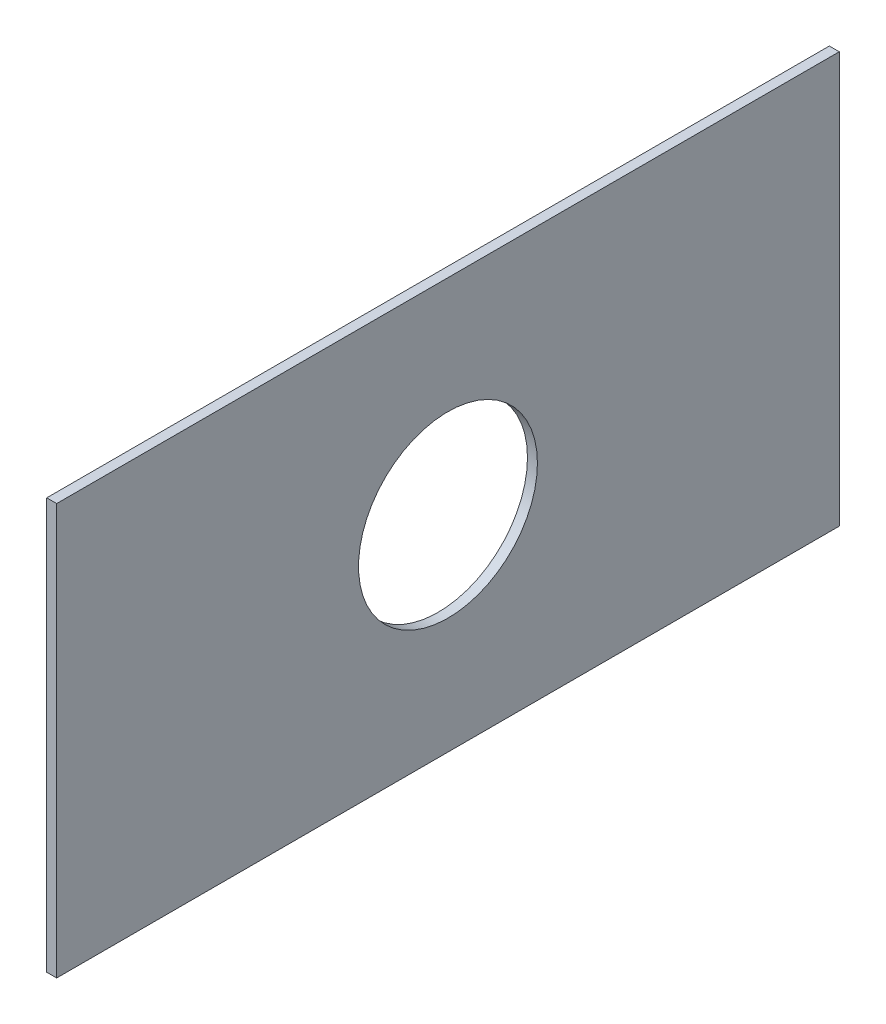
ISO-10303-21;
HEADER;
FILE_DESCRIPTION(('STEP AP214'),'2;1');
FILE_NAME('part.step','',(''),(''),'','','');
FILE_SCHEMA(('AUTOMOTIVE_DESIGN { 1 0 10303 214 1 1 1 1 }'));
ENDSEC;
DATA;
#1=APPLICATION_CONTEXT('core data for automotive mechanical design processes');
#2=APPLICATION_PROTOCOL_DEFINITION('international standard','automotive_design',2000,#1);
#3=PRODUCT_CONTEXT('',#1,'mechanical');
#4=PRODUCT('Part','Part','',(#3));
#5=PRODUCT_RELATED_PRODUCT_CATEGORY('part','',(#4));
#6=PRODUCT_DEFINITION_FORMATION('','',#4);
#7=PRODUCT_DEFINITION_CONTEXT('part definition',#1,'design');
#8=PRODUCT_DEFINITION('design','',#6,#7);
#9=PRODUCT_DEFINITION_SHAPE('','',#8);
#10=(LENGTH_UNIT() NAMED_UNIT(*) SI_UNIT(.MILLI.,.METRE.));
#11=(NAMED_UNIT(*) PLANE_ANGLE_UNIT() SI_UNIT($,.RADIAN.));
#12=(NAMED_UNIT(*) SI_UNIT($,.STERADIAN.) SOLID_ANGLE_UNIT());
#13=UNCERTAINTY_MEASURE_WITH_UNIT(LENGTH_MEASURE(1.E-05),#10,'distance_accuracy_value','');
#14=(GEOMETRIC_REPRESENTATION_CONTEXT(3) GLOBAL_UNCERTAINTY_ASSIGNED_CONTEXT((#13)) GLOBAL_UNIT_ASSIGNED_CONTEXT((#10,
#11,#12)) REPRESENTATION_CONTEXT('',''));
#15=CARTESIAN_POINT('',(0.,0.,0.));
#16=DIRECTION('',(0.,0.,1.));
#17=DIRECTION('',(1.,0.,0.));
#18=AXIS2_PLACEMENT_3D('',#15,#16,#17);
#19=CARTESIAN_POINT('',(12.7,0.,0.));
#20=DIRECTION('',(0.,0.,-1.));
#21=DIRECTION('',(-1.,0.,0.));
#22=AXIS2_PLACEMENT_3D('',#19,#20,#21);
#23=PLANE('',#22);
#24=DIRECTION('',(0.,-1.,0.));
#25=VECTOR('',#24,1.);
#26=CARTESIAN_POINT('',(0.,0.,0.));
#27=LINE('',#26,#25);
#28=CARTESIAN_POINT('',(0.,525.018,0.));
#29=VERTEX_POINT('',#28);
#30=CARTESIAN_POINT('',(0.,0.,0.));
#31=VERTEX_POINT('',#30);
#32=EDGE_CURVE('E94',#29,#31,#27,.T.);
#33=ORIENTED_EDGE('',*,*,#32,.T.);
#34=DIRECTION('',(-1.,0.,0.));
#35=VECTOR('',#34,1.);
#36=CARTESIAN_POINT('',(12.7,0.,0.));
#37=LINE('',#36,#35);
#38=CARTESIAN_POINT('',(12.7,0.,0.));
#39=VERTEX_POINT('',#38);
#40=EDGE_CURVE('E11',#39,#31,#37,.T.);
#41=ORIENTED_EDGE('',*,*,#40,.F.);
#42=DIRECTION('',(0.,-1.,0.));
#43=VECTOR('',#42,1.);
#44=CARTESIAN_POINT('',(12.7,0.,0.));
#45=LINE('',#44,#43);
#46=CARTESIAN_POINT('',(12.7,525.018,0.));
#47=VERTEX_POINT('',#46);
#48=EDGE_CURVE('E82',#47,#39,#45,.T.);
#49=ORIENTED_EDGE('',*,*,#48,.F.);
#50=DIRECTION('',(-1.,0.,0.));
#51=VECTOR('',#50,1.);
#52=CARTESIAN_POINT('',(12.7,525.018,0.));
#53=LINE('',#52,#51);
#54=EDGE_CURVE('E90',#47,#29,#53,.T.);
#55=ORIENTED_EDGE('',*,*,#54,.T.);
#56=EDGE_LOOP('',(#33,#41,#49,#55));
#57=FACE_BOUND('',#56,.T.);
#58=ADVANCED_FACE('F31',(#57),#23,.F.);
#59=CARTESIAN_POINT('',(12.7,0.,0.));
#60=DIRECTION('',(0.,1.,0.));
#61=DIRECTION('',(0.,0.,1.));
#62=AXIS2_PLACEMENT_3D('',#59,#60,#61);
#63=PLANE('',#62);
#64=DIRECTION('',(0.,0.,-1.));
#65=VECTOR('',#64,1.);
#66=CARTESIAN_POINT('',(0.,0.,0.));
#67=LINE('',#66,#65);
#68=CARTESIAN_POINT('',(0.,0.,-999.998));
#69=VERTEX_POINT('',#68);
#70=EDGE_CURVE('E86',#31,#69,#67,.T.);
#71=ORIENTED_EDGE('',*,*,#70,.T.);
#72=DIRECTION('',(-1.,0.,0.));
#73=VECTOR('',#72,1.);
#74=CARTESIAN_POINT('',(12.7,0.,-999.998));
#75=LINE('',#74,#73);
#76=CARTESIAN_POINT('',(12.7,0.,-999.998));
#77=VERTEX_POINT('',#76);
#78=EDGE_CURVE('E39',#77,#69,#75,.T.);
#79=ORIENTED_EDGE('',*,*,#78,.F.);
#80=DIRECTION('',(0.,0.,-1.));
#81=VECTOR('',#80,1.);
#82=CARTESIAN_POINT('',(12.7,0.,0.));
#83=LINE('',#82,#81);
#84=EDGE_CURVE('E77',#39,#77,#83,.T.);
#85=ORIENTED_EDGE('',*,*,#84,.F.);
#86=ORIENTED_EDGE('',*,*,#40,.T.);
#87=EDGE_LOOP('',(#71,#79,#85,#86));
#88=FACE_BOUND('',#87,.T.);
#89=ADVANCED_FACE('F85',(#88),#63,.F.);
#90=CARTESIAN_POINT('',(12.7,0.,-999.998));
#91=DIRECTION('',(0.,0.,1.));
#92=DIRECTION('',(1.,0.,0.));
#93=AXIS2_PLACEMENT_3D('',#90,#91,#92);
#94=PLANE('',#93);
#95=DIRECTION('',(0.,1.,0.));
#96=VECTOR('',#95,1.);
#97=CARTESIAN_POINT('',(0.,0.,-999.998));
#98=LINE('',#97,#96);
#99=CARTESIAN_POINT('',(0.,525.018,-999.998));
#100=VERTEX_POINT('',#99);
#101=EDGE_CURVE('E64',#69,#100,#98,.T.);
#102=ORIENTED_EDGE('',*,*,#101,.T.);
#103=DIRECTION('',(-1.,0.,0.));
#104=VECTOR('',#103,1.);
#105=CARTESIAN_POINT('',(12.7,525.018,-999.998));
#106=LINE('',#105,#104);
#107=CARTESIAN_POINT('',(12.7,525.018,-999.998));
#108=VERTEX_POINT('',#107);
#109=EDGE_CURVE('E87',#108,#100,#106,.T.);
#110=ORIENTED_EDGE('',*,*,#109,.F.);
#111=DIRECTION('',(0.,1.,0.));
#112=VECTOR('',#111,1.);
#113=CARTESIAN_POINT('',(12.7,0.,-999.998));
#114=LINE('',#113,#112);
#115=EDGE_CURVE('E80',#77,#108,#114,.T.);
#116=ORIENTED_EDGE('',*,*,#115,.F.);
#117=ORIENTED_EDGE('',*,*,#78,.T.);
#118=EDGE_LOOP('',(#102,#110,#116,#117));
#119=FACE_BOUND('',#118,.T.);
#120=ADVANCED_FACE('F88',(#119),#94,.F.);
#121=CARTESIAN_POINT('',(12.7,525.018,0.));
#122=DIRECTION('',(0.,-1.,0.));
#123=DIRECTION('',(0.,0.,-1.));
#124=AXIS2_PLACEMENT_3D('',#121,#122,#123);
#125=PLANE('',#124);
#126=DIRECTION('',(0.,0.,1.));
#127=VECTOR('',#126,1.);
#128=CARTESIAN_POINT('',(0.,525.018,0.));
#129=LINE('',#128,#127);
#130=EDGE_CURVE('E70',#100,#29,#129,.T.);
#131=ORIENTED_EDGE('',*,*,#130,.T.);
#132=ORIENTED_EDGE('',*,*,#54,.F.);
#133=DIRECTION('',(0.,0.,1.));
#134=VECTOR('',#133,1.);
#135=CARTESIAN_POINT('',(12.7,525.018,0.));
#136=LINE('',#135,#134);
#137=EDGE_CURVE('E47',#108,#47,#136,.T.);
#138=ORIENTED_EDGE('',*,*,#137,.F.);
#139=ORIENTED_EDGE('',*,*,#109,.T.);
#140=EDGE_LOOP('',(#131,#132,#138,#139));
#141=FACE_BOUND('',#140,.T.);
#142=ADVANCED_FACE('F102',(#141),#125,.F.);
#143=CARTESIAN_POINT('',(12.7,525.018,0.));
#144=DIRECTION('',(-1.,0.,0.));
#145=DIRECTION('',(0.,0.,1.));
#146=AXIS2_PLACEMENT_3D('',#143,#144,#145);
#147=PLANE('',#146);
#148=CARTESIAN_POINT('',(12.7,262.509,-499.999));
#149=DIRECTION('',(1.,0.,0.));
#150=DIRECTION('',(0.,0.,-1.));
#151=AXIS2_PLACEMENT_3D('',#148,#149,#150);
#152=CIRCLE('',#151,114.3);
#153=CARTESIAN_POINT('',(12.7,262.509,-614.299));
#154=VERTEX_POINT('',#153);
#155=EDGE_CURVE('E108',#154,#154,#152,.T.);
#156=ORIENTED_EDGE('',*,*,#155,.F.);
#157=EDGE_LOOP('',(#156));
#158=FACE_BOUND('',#157,.T.);
#159=ORIENTED_EDGE('',*,*,#48,.T.);
#160=ORIENTED_EDGE('',*,*,#84,.T.);
#161=ORIENTED_EDGE('',*,*,#115,.T.);
#162=ORIENTED_EDGE('',*,*,#137,.T.);
#163=EDGE_LOOP('',(#159,#160,#161,#162));
#164=FACE_BOUND('',#163,.T.);
#165=ADVANCED_FACE('F78',(#158,#164),#147,.F.);
#166=CARTESIAN_POINT('',(0.,525.018,0.));
#167=DIRECTION('',(-1.,0.,0.));
#168=DIRECTION('',(0.,0.,1.));
#169=AXIS2_PLACEMENT_3D('',#166,#167,#168);
#170=PLANE('',#169);
#171=CARTESIAN_POINT('',(0.,262.509,-499.999));
#172=DIRECTION('',(1.,0.,0.));
#173=DIRECTION('',(0.,0.,-1.));
#174=AXIS2_PLACEMENT_3D('',#171,#172,#173);
#175=CIRCLE('',#174,114.3);
#176=CARTESIAN_POINT('',(0.,262.509,-614.299));
#177=VERTEX_POINT('',#176);
#178=EDGE_CURVE('E97',#177,#177,#175,.T.);
#179=ORIENTED_EDGE('',*,*,#178,.T.);
#180=EDGE_LOOP('',(#179));
#181=FACE_BOUND('',#180,.T.);
#182=ORIENTED_EDGE('',*,*,#32,.F.);
#183=ORIENTED_EDGE('',*,*,#130,.F.);
#184=ORIENTED_EDGE('',*,*,#101,.F.);
#185=ORIENTED_EDGE('',*,*,#70,.F.);
#186=EDGE_LOOP('',(#182,#183,#184,#185));
#187=FACE_BOUND('',#186,.T.);
#188=ADVANCED_FACE('F105',(#181,#187),#170,.T.);
#189=CARTESIAN_POINT('',(0.,262.509,-499.999));
#190=DIRECTION('',(1.,0.,0.));
#191=DIRECTION('',(0.,0.,-1.));
#192=AXIS2_PLACEMENT_3D('',#189,#190,#191);
#193=CYLINDRICAL_SURFACE('',#192,114.3);
#194=ORIENTED_EDGE('',*,*,#178,.F.);
#195=EDGE_LOOP('',(#194));
#196=FACE_BOUND('',#195,.T.);
#197=ORIENTED_EDGE('',*,*,#155,.T.);
#198=EDGE_LOOP('',(#197));
#199=FACE_BOUND('',#198,.T.);
#200=ADVANCED_FACE('F115',(#196,#199),#193,.F.);
#201=CLOSED_SHELL('',(#58,#89,#120,#142,#165,#188,#200));
#202=MANIFOLD_SOLID_BREP('B2',#201);
#203=ADVANCED_BREP_SHAPE_REPRESENTATION('',(#18,#202),#14);
#204=SHAPE_DEFINITION_REPRESENTATION(#9,#203);
ENDSEC;
END-ISO-10303-21;
